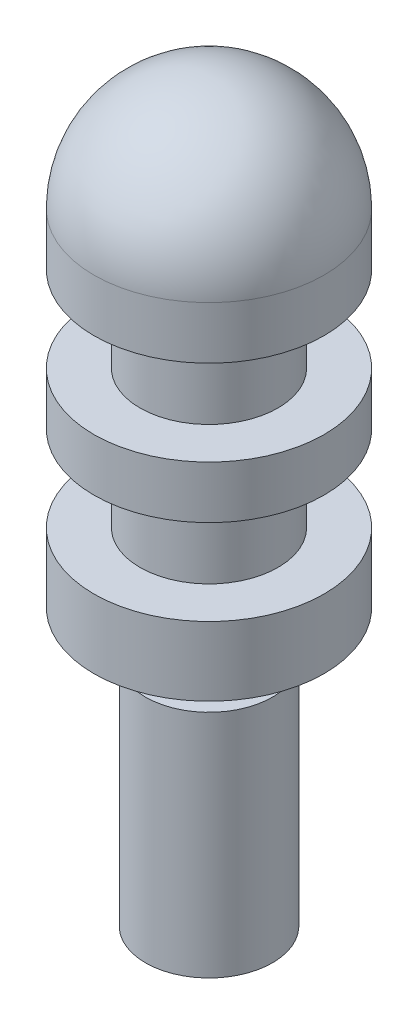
ISO-10303-21;
HEADER;
FILE_DESCRIPTION(('STEP AP214'),'2;1');
FILE_NAME('part.step','',(''),(''),'','','');
FILE_SCHEMA(('AUTOMOTIVE_DESIGN { 1 0 10303 214 1 1 1 1 }'));
ENDSEC;
DATA;
#1=APPLICATION_CONTEXT('core data for automotive mechanical design processes');
#2=APPLICATION_PROTOCOL_DEFINITION('international standard','automotive_design',2000,#1);
#3=PRODUCT_CONTEXT('',#1,'mechanical');
#4=PRODUCT('Part','Part','',(#3));
#5=PRODUCT_RELATED_PRODUCT_CATEGORY('part','',(#4));
#6=PRODUCT_DEFINITION_FORMATION('','',#4);
#7=PRODUCT_DEFINITION_CONTEXT('part definition',#1,'design');
#8=PRODUCT_DEFINITION('design','',#6,#7);
#9=PRODUCT_DEFINITION_SHAPE('','',#8);
#10=(LENGTH_UNIT() NAMED_UNIT(*) SI_UNIT(.MILLI.,.METRE.));
#11=(NAMED_UNIT(*) PLANE_ANGLE_UNIT() SI_UNIT($,.RADIAN.));
#12=(NAMED_UNIT(*) SI_UNIT($,.STERADIAN.) SOLID_ANGLE_UNIT());
#13=UNCERTAINTY_MEASURE_WITH_UNIT(LENGTH_MEASURE(1.E-05),#10,'distance_accuracy_value','');
#14=(GEOMETRIC_REPRESENTATION_CONTEXT(3) GLOBAL_UNCERTAINTY_ASSIGNED_CONTEXT((#13)) GLOBAL_UNIT_ASSIGNED_CONTEXT((#10,
#11,#12)) REPRESENTATION_CONTEXT('',''));
#15=CARTESIAN_POINT('',(0.,0.,0.));
#16=DIRECTION('',(0.,0.,1.));
#17=DIRECTION('',(1.,0.,0.));
#18=AXIS2_PLACEMENT_3D('',#15,#16,#17);
#19=CARTESIAN_POINT('',(0.,17.145,0.));
#20=DIRECTION('',(0.,1.,0.));
#21=DIRECTION('',(1.,0.,0.));
#22=AXIS2_PLACEMENT_3D('',#19,#20,#21);
#23=SPHERICAL_SURFACE('',#22,3.175);
#24=CARTESIAN_POINT('',(0.,17.145,0.));
#25=DIRECTION('',(0.,1.,0.));
#26=DIRECTION('',(0.,0.,1.));
#27=AXIS2_PLACEMENT_3D('',#24,#25,#26);
#28=CIRCLE('',#27,3.175);
#29=CARTESIAN_POINT('',(0.,17.145,3.175));
#30=VERTEX_POINT('',#29);
#31=EDGE_CURVE('E109',#30,#30,#28,.T.);
#32=ORIENTED_EDGE('',*,*,#31,.T.);
#33=EDGE_LOOP('',(#32));
#34=FACE_BOUND('',#33,.T.);
#35=ADVANCED_FACE('F39',(#34),#23,.T.);
#36=CARTESIAN_POINT('',(0.,5.08,0.));
#37=DIRECTION('',(0.,-1.,0.));
#38=DIRECTION('',(0.,0.,-1.));
#39=AXIS2_PLACEMENT_3D('',#36,#37,#38);
#40=CONICAL_SURFACE('',#39,0.3937,1.02974425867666);
#41=CARTESIAN_POINT('',(0.,5.31655882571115,0.));
#42=VERTEX_POINT('',#41);
#43=VERTEX_LOOP('',#42);
#44=FACE_BOUND('',#43,.T.);
#45=CARTESIAN_POINT('',(0.,5.08,0.));
#46=DIRECTION('',(0.,1.,0.));
#47=DIRECTION('',(0.,0.,1.));
#48=AXIS2_PLACEMENT_3D('',#45,#46,#47);
#49=CIRCLE('',#48,0.3937);
#50=CARTESIAN_POINT('',(0.,5.08,0.3937));
#51=VERTEX_POINT('',#50);
#52=EDGE_CURVE('E11',#51,#51,#49,.T.);
#53=ORIENTED_EDGE('',*,*,#52,.F.);
#54=EDGE_LOOP('',(#53));
#55=FACE_BOUND('',#54,.T.);
#56=ADVANCED_FACE('F50',(#44,#55),#40,.F.);
#57=CARTESIAN_POINT('',(0.,0.,0.));
#58=DIRECTION('',(0.,1.,0.));
#59=DIRECTION('',(0.,0.,1.));
#60=AXIS2_PLACEMENT_3D('',#57,#58,#59);
#61=CYLINDRICAL_SURFACE('',#60,0.3937);
#62=ORIENTED_EDGE('',*,*,#52,.T.);
#63=EDGE_LOOP('',(#62));
#64=FACE_BOUND('',#63,.T.);
#65=CARTESIAN_POINT('',(0.,0.,0.));
#66=DIRECTION('',(0.,1.,0.));
#67=DIRECTION('',(0.,0.,1.));
#68=AXIS2_PLACEMENT_3D('',#65,#66,#67);
#69=CIRCLE('',#68,0.3937);
#70=CARTESIAN_POINT('',(0.,0.,0.3937));
#71=VERTEX_POINT('',#70);
#72=EDGE_CURVE('E46',#71,#71,#69,.T.);
#73=ORIENTED_EDGE('',*,*,#72,.F.);
#74=EDGE_LOOP('',(#73));
#75=FACE_BOUND('',#74,.T.);
#76=ADVANCED_FACE('F53',(#64,#75),#61,.F.);
#77=CARTESIAN_POINT('',(-0.3937,0.,0.));
#78=DIRECTION('',(0.,-1.,0.));
#79=DIRECTION('',(0.,0.,-1.));
#80=AXIS2_PLACEMENT_3D('',#77,#78,#79);
#81=PLANE('',#80);
#82=ORIENTED_EDGE('',*,*,#72,.T.);
#83=EDGE_LOOP('',(#82));
#84=FACE_BOUND('',#83,.T.);
#85=CARTESIAN_POINT('',(0.,0.,0.));
#86=DIRECTION('',(0.,1.,0.));
#87=DIRECTION('',(0.,0.,1.));
#88=AXIS2_PLACEMENT_3D('',#85,#86,#87);
#89=CIRCLE('',#88,1.7526);
#90=CARTESIAN_POINT('',(0.,0.,1.7526));
#91=VERTEX_POINT('',#90);
#92=EDGE_CURVE('E63',#91,#91,#89,.T.);
#93=ORIENTED_EDGE('',*,*,#92,.F.);
#94=EDGE_LOOP('',(#93));
#95=FACE_BOUND('',#94,.T.);
#96=ADVANCED_FACE('F58',(#84,#95),#81,.T.);
#97=CARTESIAN_POINT('',(0.,0.,0.));
#98=DIRECTION('',(0.,1.,0.));
#99=DIRECTION('',(0.,0.,1.));
#100=AXIS2_PLACEMENT_3D('',#97,#98,#99);
#101=CYLINDRICAL_SURFACE('',#100,1.7526);
#102=ORIENTED_EDGE('',*,*,#92,.T.);
#103=EDGE_LOOP('',(#102));
#104=FACE_BOUND('',#103,.T.);
#105=CARTESIAN_POINT('',(0.,6.35,0.));
#106=DIRECTION('',(0.,1.,0.));
#107=DIRECTION('',(0.,0.,1.));
#108=AXIS2_PLACEMENT_3D('',#105,#106,#107);
#109=CIRCLE('',#108,1.7526);
#110=CARTESIAN_POINT('',(0.,6.35,1.7526));
#111=VERTEX_POINT('',#110);
#112=EDGE_CURVE('E65',#111,#111,#109,.T.);
#113=ORIENTED_EDGE('',*,*,#112,.F.);
#114=EDGE_LOOP('',(#113));
#115=FACE_BOUND('',#114,.T.);
#116=ADVANCED_FACE('F142',(#104,#115),#101,.T.);
#117=CARTESIAN_POINT('',(-1.26619,6.35,0.));
#118=DIRECTION('',(0.,1.,0.));
#119=DIRECTION('',(0.,0.,1.));
#120=AXIS2_PLACEMENT_3D('',#117,#118,#119);
#121=PLANE('',#120);
#122=ORIENTED_EDGE('',*,*,#112,.T.);
#123=EDGE_LOOP('',(#122));
#124=FACE_BOUND('',#123,.T.);
#125=CARTESIAN_POINT('',(0.,6.35,0.));
#126=DIRECTION('',(0.,1.,0.));
#127=DIRECTION('',(0.,0.,1.));
#128=AXIS2_PLACEMENT_3D('',#125,#126,#127);
#129=CIRCLE('',#128,1.26619);
#130=CARTESIAN_POINT('',(0.,6.35,1.26619));
#131=VERTEX_POINT('',#130);
#132=EDGE_CURVE('E71',#131,#131,#129,.T.);
#133=ORIENTED_EDGE('',*,*,#132,.F.);
#134=EDGE_LOOP('',(#133));
#135=FACE_BOUND('',#134,.T.);
#136=ADVANCED_FACE('F150',(#124,#135),#121,.T.);
#137=CARTESIAN_POINT('',(0.,0.,0.));
#138=DIRECTION('',(0.,1.,0.));
#139=DIRECTION('',(0.,0.,1.));
#140=AXIS2_PLACEMENT_3D('',#137,#138,#139);
#141=CYLINDRICAL_SURFACE('',#140,1.26619);
#142=ORIENTED_EDGE('',*,*,#132,.T.);
#143=EDGE_LOOP('',(#142));
#144=FACE_BOUND('',#143,.T.);
#145=CARTESIAN_POINT('',(0.,7.62,0.));
#146=DIRECTION('',(0.,1.,0.));
#147=DIRECTION('',(0.,0.,1.));
#148=AXIS2_PLACEMENT_3D('',#145,#146,#147);
#149=CIRCLE('',#148,1.26619);
#150=CARTESIAN_POINT('',(0.,7.62,1.26619));
#151=VERTEX_POINT('',#150);
#152=EDGE_CURVE('E75',#151,#151,#149,.T.);
#153=ORIENTED_EDGE('',*,*,#152,.F.);
#154=EDGE_LOOP('',(#153));
#155=FACE_BOUND('',#154,.T.);
#156=ADVANCED_FACE('F156',(#144,#155),#141,.T.);
#157=CARTESIAN_POINT('',(-3.175,7.62,0.));
#158=DIRECTION('',(0.,-1.,0.));
#159=DIRECTION('',(0.,0.,-1.));
#160=AXIS2_PLACEMENT_3D('',#157,#158,#159);
#161=PLANE('',#160);
#162=ORIENTED_EDGE('',*,*,#152,.T.);
#163=EDGE_LOOP('',(#162));
#164=FACE_BOUND('',#163,.T.);
#165=CARTESIAN_POINT('',(0.,7.62,0.));
#166=DIRECTION('',(0.,1.,0.));
#167=DIRECTION('',(0.,0.,1.));
#168=AXIS2_PLACEMENT_3D('',#165,#166,#167);
#169=CIRCLE('',#168,3.175);
#170=CARTESIAN_POINT('',(0.,7.62,3.175));
#171=VERTEX_POINT('',#170);
#172=EDGE_CURVE('E79',#171,#171,#169,.T.);
#173=ORIENTED_EDGE('',*,*,#172,.F.);
#174=EDGE_LOOP('',(#173));
#175=FACE_BOUND('',#174,.T.);
#176=ADVANCED_FACE('F164',(#164,#175),#161,.T.);
#177=CARTESIAN_POINT('',(0.,0.,0.));
#178=DIRECTION('',(0.,1.,0.));
#179=DIRECTION('',(0.,0.,1.));
#180=AXIS2_PLACEMENT_3D('',#177,#178,#179);
#181=CYLINDRICAL_SURFACE('',#180,3.175);
#182=ORIENTED_EDGE('',*,*,#172,.T.);
#183=EDGE_LOOP('',(#182));
#184=FACE_BOUND('',#183,.T.);
#185=CARTESIAN_POINT('',(0.,9.525,0.));
#186=DIRECTION('',(0.,1.,0.));
#187=DIRECTION('',(0.,0.,1.));
#188=AXIS2_PLACEMENT_3D('',#185,#186,#187);
#189=CIRCLE('',#188,3.175);
#190=CARTESIAN_POINT('',(0.,9.525,3.175));
#191=VERTEX_POINT('',#190);
#192=EDGE_CURVE('E83',#191,#191,#189,.T.);
#193=ORIENTED_EDGE('',*,*,#192,.F.);
#194=EDGE_LOOP('',(#193));
#195=FACE_BOUND('',#194,.T.);
#196=ADVANCED_FACE('F171',(#184,#195),#181,.T.);
#197=CARTESIAN_POINT('',(-3.175,9.525,0.));
#198=DIRECTION('',(0.,1.,0.));
#199=DIRECTION('',(0.,0.,1.));
#200=AXIS2_PLACEMENT_3D('',#197,#198,#199);
#201=PLANE('',#200);
#202=ORIENTED_EDGE('',*,*,#192,.T.);
#203=EDGE_LOOP('',(#202));
#204=FACE_BOUND('',#203,.T.);
#205=CARTESIAN_POINT('',(0.,9.525,0.));
#206=DIRECTION('',(0.,1.,0.));
#207=DIRECTION('',(0.,0.,1.));
#208=AXIS2_PLACEMENT_3D('',#205,#206,#207);
#209=CIRCLE('',#208,1.905);
#210=CARTESIAN_POINT('',(0.,9.525,1.905));
#211=VERTEX_POINT('',#210);
#212=EDGE_CURVE('E87',#211,#211,#209,.T.);
#213=ORIENTED_EDGE('',*,*,#212,.F.);
#214=EDGE_LOOP('',(#213));
#215=FACE_BOUND('',#214,.T.);
#216=ADVANCED_FACE('F177',(#204,#215),#201,.T.);
#217=CARTESIAN_POINT('',(0.,0.,0.));
#218=DIRECTION('',(0.,1.,0.));
#219=DIRECTION('',(0.,0.,1.));
#220=AXIS2_PLACEMENT_3D('',#217,#218,#219);
#221=CYLINDRICAL_SURFACE('',#220,1.905);
#222=ORIENTED_EDGE('',*,*,#212,.T.);
#223=EDGE_LOOP('',(#222));
#224=FACE_BOUND('',#223,.T.);
#225=CARTESIAN_POINT('',(0.,11.8872,0.));
#226=DIRECTION('',(0.,1.,0.));
#227=DIRECTION('',(0.,0.,1.));
#228=AXIS2_PLACEMENT_3D('',#225,#226,#227);
#229=CIRCLE('',#228,1.905);
#230=CARTESIAN_POINT('',(0.,11.8872,1.905));
#231=VERTEX_POINT('',#230);
#232=EDGE_CURVE('E91',#231,#231,#229,.T.);
#233=ORIENTED_EDGE('',*,*,#232,.F.);
#234=EDGE_LOOP('',(#233));
#235=FACE_BOUND('',#234,.T.);
#236=ADVANCED_FACE('F184',(#224,#235),#221,.T.);
#237=CARTESIAN_POINT('',(-3.175,11.8872,0.));
#238=DIRECTION('',(0.,-1.,0.));
#239=DIRECTION('',(0.,0.,-1.));
#240=AXIS2_PLACEMENT_3D('',#237,#238,#239);
#241=PLANE('',#240);
#242=ORIENTED_EDGE('',*,*,#232,.T.);
#243=EDGE_LOOP('',(#242));
#244=FACE_BOUND('',#243,.T.);
#245=CARTESIAN_POINT('',(0.,11.8872,0.));
#246=DIRECTION('',(0.,1.,0.));
#247=DIRECTION('',(0.,0.,1.));
#248=AXIS2_PLACEMENT_3D('',#245,#246,#247);
#249=CIRCLE('',#248,3.175);
#250=CARTESIAN_POINT('',(0.,11.8872,3.175));
#251=VERTEX_POINT('',#250);
#252=EDGE_CURVE('E94',#251,#251,#249,.T.);
#253=ORIENTED_EDGE('',*,*,#252,.F.);
#254=EDGE_LOOP('',(#253));
#255=FACE_BOUND('',#254,.T.);
#256=ADVANCED_FACE('F192',(#244,#255),#241,.T.);
#257=CARTESIAN_POINT('',(0.,0.,0.));
#258=DIRECTION('',(0.,1.,0.));
#259=DIRECTION('',(0.,0.,1.));
#260=AXIS2_PLACEMENT_3D('',#257,#258,#259);
#261=CYLINDRICAL_SURFACE('',#260,3.175);
#262=ORIENTED_EDGE('',*,*,#252,.T.);
#263=EDGE_LOOP('',(#262));
#264=FACE_BOUND('',#263,.T.);
#265=CARTESIAN_POINT('',(0.,13.335,0.));
#266=DIRECTION('',(0.,1.,0.));
#267=DIRECTION('',(0.,0.,1.));
#268=AXIS2_PLACEMENT_3D('',#265,#266,#267);
#269=CIRCLE('',#268,3.175);
#270=CARTESIAN_POINT('',(0.,13.335,3.175));
#271=VERTEX_POINT('',#270);
#272=EDGE_CURVE('E97',#271,#271,#269,.T.);
#273=ORIENTED_EDGE('',*,*,#272,.F.);
#274=EDGE_LOOP('',(#273));
#275=FACE_BOUND('',#274,.T.);
#276=ADVANCED_FACE('F200',(#264,#275),#261,.T.);
#277=CARTESIAN_POINT('',(-3.175,13.335,0.));
#278=DIRECTION('',(0.,1.,0.));
#279=DIRECTION('',(0.,0.,1.));
#280=AXIS2_PLACEMENT_3D('',#277,#278,#279);
#281=PLANE('',#280);
#282=ORIENTED_EDGE('',*,*,#272,.T.);
#283=EDGE_LOOP('',(#282));
#284=FACE_BOUND('',#283,.T.);
#285=CARTESIAN_POINT('',(0.,13.335,0.));
#286=DIRECTION('',(0.,1.,0.));
#287=DIRECTION('',(0.,0.,1.));
#288=AXIS2_PLACEMENT_3D('',#285,#286,#287);
#289=CIRCLE('',#288,1.905);
#290=CARTESIAN_POINT('',(0.,13.335,1.905));
#291=VERTEX_POINT('',#290);
#292=EDGE_CURVE('E100',#291,#291,#289,.T.);
#293=ORIENTED_EDGE('',*,*,#292,.F.);
#294=EDGE_LOOP('',(#293));
#295=FACE_BOUND('',#294,.T.);
#296=ADVANCED_FACE('F208',(#284,#295),#281,.T.);
#297=CARTESIAN_POINT('',(0.,0.,0.));
#298=DIRECTION('',(0.,1.,0.));
#299=DIRECTION('',(0.,0.,1.));
#300=AXIS2_PLACEMENT_3D('',#297,#298,#299);
#301=CYLINDRICAL_SURFACE('',#300,1.905);
#302=ORIENTED_EDGE('',*,*,#292,.T.);
#303=EDGE_LOOP('',(#302));
#304=FACE_BOUND('',#303,.T.);
#305=CARTESIAN_POINT('',(0.,15.6972,0.));
#306=DIRECTION('',(0.,1.,0.));
#307=DIRECTION('',(0.,0.,1.));
#308=AXIS2_PLACEMENT_3D('',#305,#306,#307);
#309=CIRCLE('',#308,1.905);
#310=CARTESIAN_POINT('',(0.,15.6972,1.905));
#311=VERTEX_POINT('',#310);
#312=EDGE_CURVE('E103',#311,#311,#309,.T.);
#313=ORIENTED_EDGE('',*,*,#312,.F.);
#314=EDGE_LOOP('',(#313));
#315=FACE_BOUND('',#314,.T.);
#316=ADVANCED_FACE('F122',(#304,#315),#301,.T.);
#317=CARTESIAN_POINT('',(-3.175,15.6972,0.));
#318=DIRECTION('',(0.,-1.,0.));
#319=DIRECTION('',(0.,0.,-1.));
#320=AXIS2_PLACEMENT_3D('',#317,#318,#319);
#321=PLANE('',#320);
#322=ORIENTED_EDGE('',*,*,#312,.T.);
#323=EDGE_LOOP('',(#322));
#324=FACE_BOUND('',#323,.T.);
#325=CARTESIAN_POINT('',(0.,15.6972,0.));
#326=DIRECTION('',(0.,1.,0.));
#327=DIRECTION('',(0.,0.,1.));
#328=AXIS2_PLACEMENT_3D('',#325,#326,#327);
#329=CIRCLE('',#328,3.175);
#330=CARTESIAN_POINT('',(0.,15.6972,3.175));
#331=VERTEX_POINT('',#330);
#332=EDGE_CURVE('E106',#331,#331,#329,.T.);
#333=ORIENTED_EDGE('',*,*,#332,.F.);
#334=EDGE_LOOP('',(#333));
#335=FACE_BOUND('',#334,.T.);
#336=ADVANCED_FACE('F116',(#324,#335),#321,.T.);
#337=CARTESIAN_POINT('',(0.,0.,0.));
#338=DIRECTION('',(0.,1.,0.));
#339=DIRECTION('',(0.,0.,1.));
#340=AXIS2_PLACEMENT_3D('',#337,#338,#339);
#341=CYLINDRICAL_SURFACE('',#340,3.175);
#342=ORIENTED_EDGE('',*,*,#332,.T.);
#343=EDGE_LOOP('',(#342));
#344=FACE_BOUND('',#343,.T.);
#345=ORIENTED_EDGE('',*,*,#31,.F.);
#346=EDGE_LOOP('',(#345));
#347=FACE_BOUND('',#346,.T.);
#348=ADVANCED_FACE('F114',(#344,#347),#341,.T.);
#349=CLOSED_SHELL('',(#35,#56,#76,#96,#116,#136,#156,#176,#196,#216,#236,#256,#276,#296,#316,
#336,#348));
#350=MANIFOLD_SOLID_BREP('B2',#349);
#351=ADVANCED_BREP_SHAPE_REPRESENTATION('',(#18,#350),#14);
#352=SHAPE_DEFINITION_REPRESENTATION(#9,#351);
ENDSEC;
END-ISO-10303-21;
